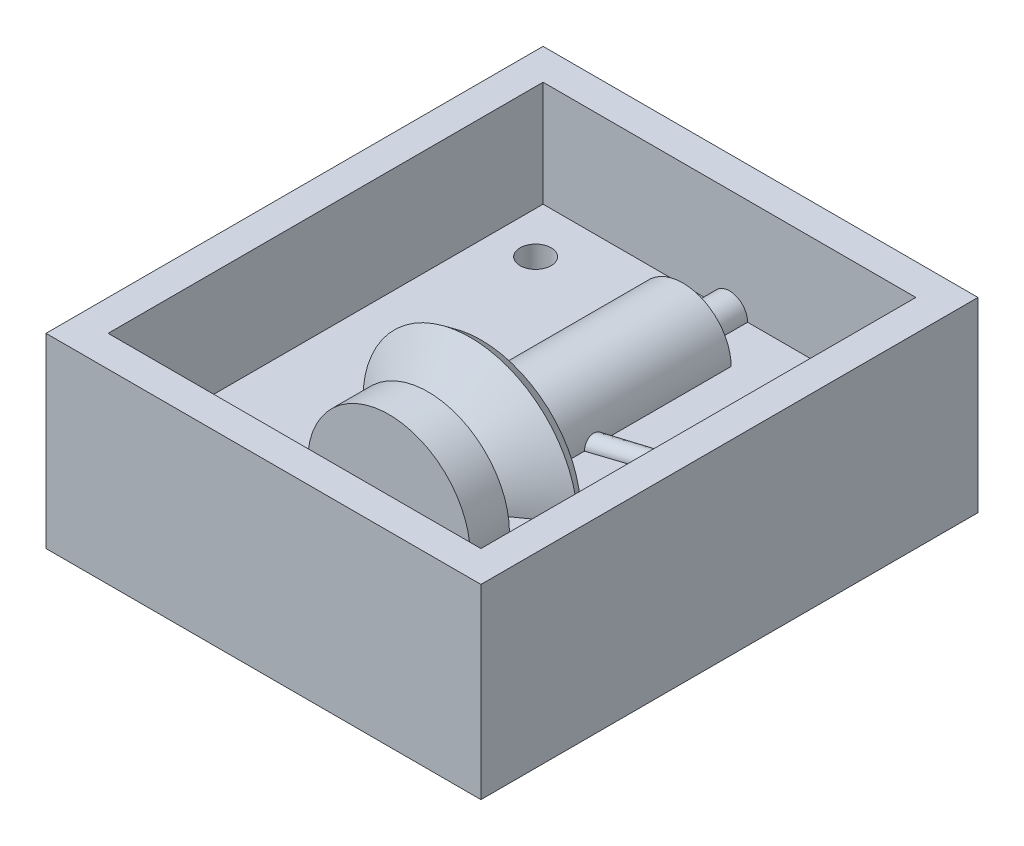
ISO-10303-21;
HEADER;
FILE_DESCRIPTION(('STEP AP214'),'2;1');
FILE_NAME('part.step','',(''),(''),'','','');
FILE_SCHEMA(('AUTOMOTIVE_DESIGN { 1 0 10303 214 1 1 1 1 }'));
ENDSEC;
DATA;
#1=APPLICATION_CONTEXT('core data for automotive mechanical design processes');
#2=APPLICATION_PROTOCOL_DEFINITION('international standard','automotive_design',2000,#1);
#3=PRODUCT_CONTEXT('',#1,'mechanical');
#4=PRODUCT('Part','Part','',(#3));
#5=PRODUCT_RELATED_PRODUCT_CATEGORY('part','',(#4));
#6=PRODUCT_DEFINITION_FORMATION('','',#4);
#7=PRODUCT_DEFINITION_CONTEXT('part definition',#1,'design');
#8=PRODUCT_DEFINITION('design','',#6,#7);
#9=PRODUCT_DEFINITION_SHAPE('','',#8);
#10=(LENGTH_UNIT() NAMED_UNIT(*) SI_UNIT(.MILLI.,.METRE.));
#11=(NAMED_UNIT(*) PLANE_ANGLE_UNIT() SI_UNIT($,.RADIAN.));
#12=(NAMED_UNIT(*) SI_UNIT($,.STERADIAN.) SOLID_ANGLE_UNIT());
#13=UNCERTAINTY_MEASURE_WITH_UNIT(LENGTH_MEASURE(1.E-05),#10,'distance_accuracy_value','');
#14=(GEOMETRIC_REPRESENTATION_CONTEXT(3) GLOBAL_UNCERTAINTY_ASSIGNED_CONTEXT((#13)) GLOBAL_UNIT_ASSIGNED_CONTEXT((#10,
#11,#12)) REPRESENTATION_CONTEXT('',''));
#15=CARTESIAN_POINT('',(0.,0.,0.));
#16=DIRECTION('',(0.,0.,1.));
#17=DIRECTION('',(1.,0.,0.));
#18=AXIS2_PLACEMENT_3D('',#15,#16,#17);
#19=CARTESIAN_POINT('',(0.,13.,0.));
#20=DIRECTION('',(0.,1.,0.));
#21=DIRECTION('',(0.,0.,1.));
#22=AXIS2_PLACEMENT_3D('',#19,#20,#21);
#23=PLANE('',#22);
#24=CARTESIAN_POINT('',(23.27604835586,13.,27.0745701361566));
#25=DIRECTION('',(0.,1.,0.));
#26=DIRECTION('',(0.,0.,1.));
#27=AXIS2_PLACEMENT_3D('',#24,#25,#26);
#28=CIRCLE('',#27,2.5);
#29=CARTESIAN_POINT('',(23.27604835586,13.,29.5745701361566));
#30=VERTEX_POINT('',#29);
#31=EDGE_CURVE('E704',#30,#30,#28,.T.);
#32=ORIENTED_EDGE('',*,*,#31,.F.);
#33=EDGE_LOOP('',(#32));
#34=FACE_BOUND('',#33,.T.);
#35=CARTESIAN_POINT('',(-23.27604835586,13.,27.0745701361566));
#36=DIRECTION('',(0.,1.,0.));
#37=DIRECTION('',(0.,0.,-1.));
#38=AXIS2_PLACEMENT_3D('',#35,#36,#37);
#39=CIRCLE('',#38,2.5);
#40=CARTESIAN_POINT('',(-23.27604835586,13.,24.5745701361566));
#41=VERTEX_POINT('',#40);
#42=EDGE_CURVE('E384',#41,#41,#39,.T.);
#43=ORIENTED_EDGE('',*,*,#42,.F.);
#44=EDGE_LOOP('',(#43));
#45=FACE_BOUND('',#44,.T.);
#46=CARTESIAN_POINT('',(-23.27604835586,13.,-27.0745701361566));
#47=DIRECTION('',(0.,1.,0.));
#48=DIRECTION('',(0.,0.,1.));
#49=AXIS2_PLACEMENT_3D('',#46,#47,#48);
#50=CIRCLE('',#49,2.5);
#51=CARTESIAN_POINT('',(-23.27604835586,13.,-24.5745701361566));
#52=VERTEX_POINT('',#51);
#53=EDGE_CURVE('E381',#52,#52,#50,.T.);
#54=ORIENTED_EDGE('',*,*,#53,.F.);
#55=EDGE_LOOP('',(#54));
#56=FACE_BOUND('',#55,.T.);
#57=DIRECTION('',(0.950522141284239,0.,-0.310656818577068));
#58=VECTOR('',#57,1.);
#59=CARTESIAN_POINT('',(245.010901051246,13.,-81.4429071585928));
#60=LINE('',#59,#58);
#61=CARTESIAN_POINT('',(7.75868278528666,13.,-3.90234694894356));
#62=VERTEX_POINT('',#61);
#63=CARTESIAN_POINT('',(30.,13.,-11.1714220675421));
#64=VERTEX_POINT('',#63);
#65=EDGE_CURVE('E394',#62,#64,#60,.T.);
#66=ORIENTED_EDGE('',*,*,#65,.F.);
#67=DIRECTION('',(0.,0.,-1.));
#68=VECTOR('',#67,1.);
#69=CARTESIAN_POINT('',(7.75868278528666,13.,-41.7837395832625));
#70=LINE('',#69,#68);
#71=CARTESIAN_POINT('',(7.75868278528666,13.,10.8758602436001));
#72=VERTEX_POINT('',#71);
#73=EDGE_CURVE('E317',#62,#72,#70,.F.);
#74=ORIENTED_EDGE('',*,*,#73,.T.);
#75=DIRECTION('',(0.814665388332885,0.,-0.57993129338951));
#76=VECTOR('',#75,1.);
#77=CARTESIAN_POINT('',(0.,13.,16.3989903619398));
#78=LINE('',#77,#76);
#79=CARTESIAN_POINT('',(16.0570986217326,13.,4.96851337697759));
#80=VERTEX_POINT('',#79);
#81=EDGE_CURVE('E314',#72,#80,#78,.T.);
#82=ORIENTED_EDGE('',*,*,#81,.T.);
#83=DIRECTION('',(-0.579931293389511,0.,-0.814665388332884));
#84=VECTOR('',#83,1.);
#85=CARTESIAN_POINT('',(0.,13.,-17.5878870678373));
#86=LINE('',#85,#84);
#87=CARTESIAN_POINT('',(17.2953970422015,13.,6.70802782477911));
#88=VERTEX_POINT('',#87);
#89=EDGE_CURVE('E311',#80,#88,#86,.F.);
#90=ORIENTED_EDGE('',*,*,#89,.T.);
#91=DIRECTION('',(0.814665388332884,0.,-0.579931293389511));
#92=VECTOR('',#91,1.);
#93=CARTESIAN_POINT('',(0.,13.,19.0200053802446));
#94=LINE('',#93,#92);
#95=CARTESIAN_POINT('',(7.75868278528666,13.,13.4968752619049));
#96=VERTEX_POINT('',#95);
#97=EDGE_CURVE('E308',#88,#96,#94,.F.);
#98=ORIENTED_EDGE('',*,*,#97,.T.);
#99=DIRECTION('',(1.,0.,0.));
#100=VECTOR('',#99,1.);
#101=CARTESIAN_POINT('',(0.,13.,13.4968752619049));
#102=LINE('',#101,#100);
#103=CARTESIAN_POINT('',(13.0927772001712,13.,13.4968752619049));
#104=VERTEX_POINT('',#103);
#105=EDGE_CURVE('E299',#96,#104,#102,.T.);
#106=ORIENTED_EDGE('',*,*,#105,.T.);
#107=DIRECTION('',(0.,0.,-1.));
#108=VECTOR('',#107,1.);
#109=CARTESIAN_POINT('',(13.0927772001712,13.,-41.7837395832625));
#110=LINE('',#109,#108);
#111=CARTESIAN_POINT('',(13.0927772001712,13.,19.8008050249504));
#112=VERTEX_POINT('',#111);
#113=EDGE_CURVE('E305',#104,#112,#110,.F.);
#114=ORIENTED_EDGE('',*,*,#113,.T.);
#115=DIRECTION('',(-1.,0.,0.));
#116=VECTOR('',#115,1.);
#117=CARTESIAN_POINT('',(0.,13.,19.8008050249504));
#118=LINE('',#117,#116);
#119=CARTESIAN_POINT('',(-13.0927772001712,13.,19.8008050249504));
#120=VERTEX_POINT('',#119);
#121=EDGE_CURVE('E302',#112,#120,#118,.T.);
#122=ORIENTED_EDGE('',*,*,#121,.T.);
#123=DIRECTION('',(0.,0.,-1.));
#124=VECTOR('',#123,1.);
#125=CARTESIAN_POINT('',(-13.0927772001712,13.,-41.7837395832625));
#126=LINE('',#125,#124);
#127=CARTESIAN_POINT('',(-13.0927772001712,13.,13.4968752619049));
#128=VERTEX_POINT('',#127);
#129=EDGE_CURVE('E298',#120,#128,#126,.T.);
#130=ORIENTED_EDGE('',*,*,#129,.T.);
#131=CARTESIAN_POINT('',(-7.75868278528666,13.,13.4968752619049));
#132=VERTEX_POINT('',#131);
#133=EDGE_CURVE('E295',#128,#132,#102,.T.);
#134=ORIENTED_EDGE('',*,*,#133,.T.);
#135=DIRECTION('',(0.814665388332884,0.,0.579931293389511));
#136=VECTOR('',#135,1.);
#137=CARTESIAN_POINT('',(0.,13.,19.0200053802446));
#138=LINE('',#137,#136);
#139=CARTESIAN_POINT('',(-17.2953970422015,13.,6.70802782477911));
#140=VERTEX_POINT('',#139);
#141=EDGE_CURVE('E292',#132,#140,#138,.F.);
#142=ORIENTED_EDGE('',*,*,#141,.T.);
#143=DIRECTION('',(-0.579931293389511,0.,0.814665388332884));
#144=VECTOR('',#143,1.);
#145=CARTESIAN_POINT('',(0.,13.,-17.5878870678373));
#146=LINE('',#145,#144);
#147=CARTESIAN_POINT('',(-16.0570986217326,13.,4.96851337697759));
#148=VERTEX_POINT('',#147);
#149=EDGE_CURVE('E289',#140,#148,#146,.F.);
#150=ORIENTED_EDGE('',*,*,#149,.T.);
#151=DIRECTION('',(0.814665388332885,0.,0.57993129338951));
#152=VECTOR('',#151,1.);
#153=CARTESIAN_POINT('',(0.,13.,16.3989903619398));
#154=LINE('',#153,#152);
#155=CARTESIAN_POINT('',(-7.75868278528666,13.,10.8758602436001));
#156=VERTEX_POINT('',#155);
#157=EDGE_CURVE('E286',#148,#156,#154,.T.);
#158=ORIENTED_EDGE('',*,*,#157,.T.);
#159=DIRECTION('',(0.,0.,-1.));
#160=VECTOR('',#159,1.);
#161=CARTESIAN_POINT('',(-7.75868278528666,13.,-41.7837395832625));
#162=LINE('',#161,#160);
#163=CARTESIAN_POINT('',(-7.75868278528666,13.,-27.5106058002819));
#164=VERTEX_POINT('',#163);
#165=EDGE_CURVE('E282',#156,#164,#162,.T.);
#166=ORIENTED_EDGE('',*,*,#165,.T.);
#167=DIRECTION('',(1.,0.,0.));
#168=VECTOR('',#167,1.);
#169=CARTESIAN_POINT('',(0.,13.,-27.5106058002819));
#170=LINE('',#169,#168);
#171=CARTESIAN_POINT('',(-2.9191090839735,13.,-27.5106058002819));
#172=VERTEX_POINT('',#171);
#173=EDGE_CURVE('E279',#164,#172,#170,.T.);
#174=ORIENTED_EDGE('',*,*,#173,.T.);
#175=DIRECTION('',(0.,0.,-1.));
#176=VECTOR('',#175,1.);
#177=CARTESIAN_POINT('',(-2.9191090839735,13.,-41.7837395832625));
#178=LINE('',#177,#176);
#179=CARTESIAN_POINT('',(-2.9191090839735,13.,-35.));
#180=VERTEX_POINT('',#179);
#181=EDGE_CURVE('E276',#172,#180,#178,.T.);
#182=ORIENTED_EDGE('',*,*,#181,.T.);
#183=DIRECTION('',(-1.,0.,0.));
#184=VECTOR('',#183,1.);
#185=CARTESIAN_POINT('',(30.,13.,-35.));
#186=LINE('',#185,#184);
#187=CARTESIAN_POINT('',(-30.,13.,-35.));
#188=VERTEX_POINT('',#187);
#189=EDGE_CURVE('E220',#180,#188,#186,.T.);
#190=ORIENTED_EDGE('',*,*,#189,.T.);
#191=DIRECTION('',(0.,0.,1.));
#192=VECTOR('',#191,1.);
#193=CARTESIAN_POINT('',(-30.,13.,35.));
#194=LINE('',#193,#192);
#195=CARTESIAN_POINT('',(-30.,13.,35.));
#196=VERTEX_POINT('',#195);
#197=EDGE_CURVE('E222',#188,#196,#194,.T.);
#198=ORIENTED_EDGE('',*,*,#197,.T.);
#199=DIRECTION('',(1.,0.,0.));
#200=VECTOR('',#199,1.);
#201=CARTESIAN_POINT('',(30.,13.,35.));
#202=LINE('',#201,#200);
#203=CARTESIAN_POINT('',(30.,13.,35.));
#204=VERTEX_POINT('',#203);
#205=EDGE_CURVE('E217',#196,#204,#202,.T.);
#206=ORIENTED_EDGE('',*,*,#205,.T.);
#207=DIRECTION('',(0.,0.,-1.));
#208=VECTOR('',#207,1.);
#209=CARTESIAN_POINT('',(30.,13.,35.));
#210=LINE('',#209,#208);
#211=EDGE_CURVE('E216',#204,#64,#210,.T.);
#212=ORIENTED_EDGE('',*,*,#211,.T.);
#213=EDGE_LOOP('',(#66,#74,#82,#90,#98,#106,#114,#122,#130,#134,#142,#150,#158,#166,#174,#182,
#190,#198,#206,#212));
#214=FACE_BOUND('',#213,.T.);
#215=ADVANCED_FACE('F35',(#34,#45,#56,#214),#23,.T.);
#216=CARTESIAN_POINT('',(0.,0.,0.));
#217=DIRECTION('',(0.,1.,0.));
#218=DIRECTION('',(0.,0.,1.));
#219=AXIS2_PLACEMENT_3D('',#216,#217,#218);
#220=PLANE('',#219);
#221=CARTESIAN_POINT('',(-25.2912885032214,0.,-1.22311134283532));
#222=CARTESIAN_POINT('',(-24.9886595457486,0.,-1.03151210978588));
#223=CARTESIAN_POINT('',(-24.6857079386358,0.,-0.840422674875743));
#224=CARTESIAN_POINT('',(-24.0790938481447,0.,-0.459372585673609));
#225=CARTESIAN_POINT('',(-23.7754313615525,0.,-0.269411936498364));
#226=CARTESIAN_POINT('',(-22.863236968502,0.,0.298639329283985));
#227=CARTESIAN_POINT('',(-22.253544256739,0.,0.674870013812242));
#228=CARTESIAN_POINT('',(-21.0285207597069,0.,1.42242268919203));
#229=CARTESIAN_POINT('',(-20.4131782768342,0.,1.79372553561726));
#230=CARTESIAN_POINT('',(-19.1779728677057,0.,2.52870718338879));
#231=CARTESIAN_POINT('',(-18.5581100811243,0.,2.89238621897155));
#232=CARTESIAN_POINT('',(-17.2607752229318,0.,3.64015219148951));
#233=CARTESIAN_POINT('',(-16.5828199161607,0.,4.02340287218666));
#234=CARTESIAN_POINT('',(-15.21867481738,0.,4.77522247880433));
#235=CARTESIAN_POINT('',(-14.5324842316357,0.,5.14378997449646));
#236=CARTESIAN_POINT('',(-13.4959059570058,0.,5.68163553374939));
#237=CARTESIAN_POINT('',(-13.1493599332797,0.,5.8583219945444));
#238=CARTESIAN_POINT('',(-12.4533980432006,0.,6.20594076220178));
#239=CARTESIAN_POINT('',(-12.1039822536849,0.,6.37687322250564));
#240=CARTESIAN_POINT('',(-11.4019998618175,0.,6.71199868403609));
#241=CARTESIAN_POINT('',(-11.049433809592,0.,6.87619283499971));
#242=CARTESIAN_POINT('',(-10.3407501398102,0.,7.19670633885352));
#243=CARTESIAN_POINT('',(-9.98463269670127,0.,7.35302607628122));
#244=CARTESIAN_POINT('',(-9.27407158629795,0.,7.65404366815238));
#245=CARTESIAN_POINT('',(-8.91968896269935,0.,7.79888513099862));
#246=CARTESIAN_POINT('',(-8.20678816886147,0.,8.07805050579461));
#247=CARTESIAN_POINT('',(-7.84827000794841,0.,8.21237444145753));
#248=CARTESIAN_POINT('',(-7.12678495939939,0.,8.46871127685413));
#249=CARTESIAN_POINT('',(-6.76381750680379,0.,8.59072259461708));
#250=CARTESIAN_POINT('',(-6.03333293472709,0.,8.82035844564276));
#251=CARTESIAN_POINT('',(-5.66581584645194,0.,8.92798307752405));
#252=CARTESIAN_POINT('',(-4.93631177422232,0.,9.12390668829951));
#253=CARTESIAN_POINT('',(-4.57444507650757,0.,9.21265058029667));
#254=CARTESIAN_POINT('',(-3.84679812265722,0.,9.3722565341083));
#255=CARTESIAN_POINT('',(-3.48101830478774,0.,9.44312057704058));
#256=CARTESIAN_POINT('',(-2.74631144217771,0.,9.56493684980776));
#257=CARTESIAN_POINT('',(-2.37738602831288,0.,9.61589882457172));
#258=CARTESIAN_POINT('',(-1.63718270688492,0.,9.69630332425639));
#259=CARTESIAN_POINT('',(-1.26590486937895,0.,9.72574648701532));
#260=CARTESIAN_POINT('',(-0.531902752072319,0.,9.7615970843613));
#261=CARTESIAN_POINT('',(-0.169206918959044,0.,9.76858325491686));
#262=CARTESIAN_POINT('',(0.555951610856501,0.,9.76090545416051));
#263=CARTESIAN_POINT('',(0.918414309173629,0.,9.74624163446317));
#264=CARTESIAN_POINT('',(1.64192147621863,0.,9.69577070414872));
#265=CARTESIAN_POINT('',(2.00296564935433,0.,9.65995939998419));
#266=CARTESIAN_POINT('',(2.72249764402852,0.,9.56836932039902));
#267=CARTESIAN_POINT('',(3.08098538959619,0.,9.51258995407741));
#268=CARTESIAN_POINT('',(3.80517197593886,0.,9.3807949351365));
#269=CARTESIAN_POINT('',(4.17076985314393,0.,9.30422877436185));
#270=CARTESIAN_POINT('',(4.89787690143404,0.,9.13376659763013));
#271=CARTESIAN_POINT('',(5.25938598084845,0.,9.039870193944));
#272=CARTESIAN_POINT('',(5.97817697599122,0.,8.83686779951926));
#273=CARTESIAN_POINT('',(6.3354578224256,0.,8.72775804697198));
#274=CARTESIAN_POINT('',(7.04569473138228,0.,8.49639234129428));
#275=CARTESIAN_POINT('',(7.39865093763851,0.,8.37413682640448));
#276=CARTESIAN_POINT('',(8.27756703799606,0.,8.05377724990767));
#277=CARTESIAN_POINT('',(8.80092396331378,0.,7.84853676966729));
#278=CARTESIAN_POINT('',(9.83930107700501,0.,7.41784248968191));
#279=CARTESIAN_POINT('',(10.3543193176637,0.,7.19238404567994));
#280=CARTESIAN_POINT('',(11.3774640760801,0.,6.72529055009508));
#281=CARTESIAN_POINT('',(11.8855843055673,0.,6.48364179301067));
#282=CARTESIAN_POINT('',(12.8955016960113,0.,5.98762816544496));
#283=CARTESIAN_POINT('',(13.3972993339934,0.,5.73326426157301));
#284=CARTESIAN_POINT('',(14.3975322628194,0.,5.21328946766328));
#285=CARTESIAN_POINT('',(14.8959464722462,0.,4.94763815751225));
#286=CARTESIAN_POINT('',(15.888231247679,0.,4.40798560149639));
#287=CARTESIAN_POINT('',(16.3821017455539,0.,4.13398423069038));
#288=CARTESIAN_POINT('',(17.3657555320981,0.,3.57928378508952));
#289=CARTESIAN_POINT('',(17.8555406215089,0.,3.29858789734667));
#290=CARTESIAN_POINT('',(18.8318248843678,0.,2.73155672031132));
#291=CARTESIAN_POINT('',(19.3183240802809,0.,2.44522146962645));
#292=CARTESIAN_POINT('',(20.6635320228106,0.,1.64470916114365));
#293=CARTESIAN_POINT('',(21.5192513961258,0.,1.12550964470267));
#294=CARTESIAN_POINT('',(23.2240805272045,0.,0.0761834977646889));
#295=CARTESIAN_POINT('',(24.0731894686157,0.,-0.453944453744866));
#296=CARTESIAN_POINT('',(25.7587021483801,0.,-1.51774772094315));
#297=CARTESIAN_POINT('',(26.5951518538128,0.,-2.05135029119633));
#298=CARTESIAN_POINT('',(27.8466963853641,0.,-2.85644322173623));
#299=CARTESIAN_POINT('',(28.2633188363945,0.,-3.1255645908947));
#300=CARTESIAN_POINT('',(29.0956465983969,0.,-3.66521768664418));
#301=CARTESIAN_POINT('',(29.5113519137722,0.,-3.93574940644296));
#302=CARTESIAN_POINT('',(29.9266510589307,0.,-4.20690349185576));
#303=B_SPLINE_CURVE_WITH_KNOTS('',3,(#221,#222,#223,#224,#225,#226,#227,#228,#229,#230,#231,
#232,#233,#234,#235,#236,#237,#238,#239,#240,#241,#242,#243,#244,#245,#246,#247,#248,#249,#250,
#251,#252,#253,#254,#255,#256,#257,#258,#259,#260,#261,#262,#263,#264,#265,#266,#267,#268,#269,
#270,#271,#272,#273,#274,#275,#276,#277,#278,#279,#280,#281,#282,#283,#284,#285,#286,#287,#288,
#289,#290,#291,#292,#293,#294,#295,#296,#297,#298,#299,#300,#301,#302),.UNSPECIFIED.,.F.,.F.,(4,
2,2,2,2,2,2,2,2,2,2,2,2,2,2,2,2,2,2,2,2,2,2,2,2,2,2,2,2,2,2,2,2,2,2,2,2,2,2,2,4),(0.,
1.07454590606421,2.14909667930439,4.2983620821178,6.45438257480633,8.61033672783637,
10.9465616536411,13.2830135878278,14.4499375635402,15.6168303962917,16.7835232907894,
17.950159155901,19.0985350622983,20.246908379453,21.3954290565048,22.5439418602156,
23.6613105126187,24.7785553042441,25.8952523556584,27.0119163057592,28.0995620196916,
29.1872001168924,30.2750539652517,31.3629400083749,32.4830522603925,33.6031895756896,
34.7236043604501,35.8439818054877,37.5298882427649,39.2161829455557,40.9039236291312,
42.5915362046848,44.2858081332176,45.9801054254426,47.6736116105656,49.3671062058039,
52.3697165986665,55.3726920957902,58.349130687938,59.8370819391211,61.3250260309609),.UNSPECIFIED.);
#304=CARTESIAN_POINT('',(11.4074869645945,0.,6.70802782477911));
#305=VERTEX_POINT('',#304);
#306=CARTESIAN_POINT('',(-11.4074869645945,0.,6.70802782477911));
#307=VERTEX_POINT('',#306);
#308=EDGE_CURVE('E461',#305,#307,#303,.F.);
#309=ORIENTED_EDGE('',*,*,#308,.F.);
#310=CARTESIAN_POINT('',(-29.3372990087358,0.,27.4889309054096));
#311=CARTESIAN_POINT('',(-28.9705383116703,0.,27.0179002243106));
#312=CARTESIAN_POINT('',(-28.6030814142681,0.,26.5474114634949));
#313=CARTESIAN_POINT('',(-27.8666027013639,0.,25.6076570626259));
#314=CARTESIAN_POINT('',(-27.4975808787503,0.,25.1383914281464));
#315=CARTESIAN_POINT('',(-26.3878020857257,0.,23.7325024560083));
#316=CARTESIAN_POINT('',(-25.6444429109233,0.,22.7979299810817));
#317=CARTESIAN_POINT('',(-24.1436940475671,0.,20.9291419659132));
#318=CARTESIAN_POINT('',(-23.3862421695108,0.,19.9949762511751));
#319=CARTESIAN_POINT('',(-22.241558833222,0.,18.6007813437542));
#320=CARTESIAN_POINT('',(-21.8585972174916,0.,18.1372456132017));
#321=CARTESIAN_POINT('',(-21.0894049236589,0.,17.2128958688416));
#322=CARTESIAN_POINT('',(-20.703174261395,0.,16.7520818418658));
#323=CARTESIAN_POINT('',(-19.9268383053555,0.,15.8334948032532));
#324=CARTESIAN_POINT('',(-19.5367319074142,0.,15.3757227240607));
#325=CARTESIAN_POINT('',(-18.7521604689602,0.,14.4639327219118));
#326=CARTESIAN_POINT('',(-18.3576954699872,0.,14.0099147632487));
#327=CARTESIAN_POINT('',(-17.5635499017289,0.,13.1062102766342));
#328=CARTESIAN_POINT('',(-17.1638677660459,0.,12.6565251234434));
#329=CARTESIAN_POINT('',(-16.3585078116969,0.,11.762556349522));
#330=CARTESIAN_POINT('',(-15.9528300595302,0.,11.3182726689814));
#331=CARTESIAN_POINT('',(-15.1357652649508,0.,10.4378312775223));
#332=CARTESIAN_POINT('',(-14.7244028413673,0.,10.0016507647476));
#333=CARTESIAN_POINT('',(-13.8931776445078,0.,9.13739782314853));
#334=CARTESIAN_POINT('',(-13.4733144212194,0.,8.70932582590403));
#335=CARTESIAN_POINT('',(-12.6235545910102,0.,7.86367787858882));
#336=CARTESIAN_POINT('',(-12.1936633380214,0.,7.44609656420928));
#337=CARTESIAN_POINT('',(-11.3214288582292,0.,6.62419243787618));
#338=CARTESIAN_POINT('',(-10.8790874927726,0.,6.21986766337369));
#339=CARTESIAN_POINT('',(-10.1123487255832,0.,5.54589010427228));
#340=CARTESIAN_POINT('',(-9.79183396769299,0.,5.27182728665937));
#341=CARTESIAN_POINT('',(-9.14192081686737,0.,4.73437813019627));
#342=CARTESIAN_POINT('',(-8.81252219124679,0.,4.47099207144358));
#343=CARTESIAN_POINT('',(-8.1423577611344,0.,3.95673451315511));
#344=CARTESIAN_POINT('',(-7.80155884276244,0.,3.70590592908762));
#345=CARTESIAN_POINT('',(-7.10799710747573,0.,3.22123618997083));
#346=CARTESIAN_POINT('',(-6.75523402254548,0.,2.98739541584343));
#347=CARTESIAN_POINT('',(-6.02990485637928,0.,2.53760358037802));
#348=CARTESIAN_POINT('',(-5.65710250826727,0.,2.32202945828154));
#349=CARTESIAN_POINT('',(-4.89591043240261,0.,1.91987758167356));
#350=CARTESIAN_POINT('',(-4.50751751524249,0.,1.73330579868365));
#351=CARTESIAN_POINT('',(-3.71671682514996,0.,1.39839400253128));
#352=CARTESIAN_POINT('',(-3.31439842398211,0.,1.24984828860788));
#353=CARTESIAN_POINT('',(-2.70050968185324,0.,1.06176706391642));
#354=CARTESIAN_POINT('',(-2.4941955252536,0.,1.0048723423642));
#355=CARTESIAN_POINT('',(-2.07850781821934,0.,0.903727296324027));
#356=CARTESIAN_POINT('',(-1.86913484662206,0.,0.859474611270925));
#357=CARTESIAN_POINT('',(-1.38772278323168,0.,0.773898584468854));
#358=CARTESIAN_POINT('',(-1.11487434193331,0.,0.737026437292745));
#359=CARTESIAN_POINT('',(-0.567030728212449,0.,0.687348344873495));
#360=CARTESIAN_POINT('',(-0.292035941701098,0.,0.674538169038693));
#361=CARTESIAN_POINT('',(0.257838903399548,0.,0.673528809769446));
#362=CARTESIAN_POINT('',(0.532718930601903,0.,0.685314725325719));
#363=CARTESIAN_POINT('',(1.0803883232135,0.,0.732948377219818));
#364=CARTESIAN_POINT('',(1.35317737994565,0.,0.768799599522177));
#365=CARTESIAN_POINT('',(1.95319222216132,0.,0.873288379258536));
#366=CARTESIAN_POINT('',(2.27947828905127,0.,0.947327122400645));
#367=CARTESIAN_POINT('',(2.92387368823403,0.,1.12494597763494));
#368=CARTESIAN_POINT('',(3.2419803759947,0.,1.22853551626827));
#369=CARTESIAN_POINT('',(3.86992599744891,0.,1.46123473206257));
#370=CARTESIAN_POINT('',(4.17973081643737,0.,1.59043547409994));
#371=CARTESIAN_POINT('',(4.78959451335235,0.,1.86981993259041));
#372=CARTESIAN_POINT('',(5.08965416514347,0.,2.02000197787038));
#373=CARTESIAN_POINT('',(5.75932076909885,0.,2.3800069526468));
#374=CARTESIAN_POINT('',(6.12610917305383,0.,2.59504841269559));
#375=CARTESIAN_POINT('',(6.84625746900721,0.,3.04669259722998));
#376=CARTESIAN_POINT('',(7.19961048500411,0.,3.28330615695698));
#377=CARTESIAN_POINT('',(7.89504526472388,0.,3.77378758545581));
#378=CARTESIAN_POINT('',(8.23710471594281,0.,4.02768689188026));
#379=CARTESIAN_POINT('',(8.91081443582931,0.,4.54875296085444));
#380=CARTESIAN_POINT('',(9.24246641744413,0.,4.81591752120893));
#381=CARTESIAN_POINT('',(9.90057685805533,0.,5.36398057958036));
#382=CARTESIAN_POINT('',(10.2269338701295,0.,5.64500040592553));
#383=CARTESIAN_POINT('',(10.8718388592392,0.,6.21585259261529));
#384=CARTESIAN_POINT('',(11.1903865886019,0.,6.50568523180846));
#385=CARTESIAN_POINT('',(11.8203923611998,0.,7.0922289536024));
#386=CARTESIAN_POINT('',(12.131858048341,0.,7.38893184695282));
#387=CARTESIAN_POINT('',(12.7489769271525,0.,7.98830025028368));
#388=CARTESIAN_POINT('',(13.0546301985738,0.,8.29096567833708));
#389=CARTESIAN_POINT('',(13.7322209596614,0.,8.97309738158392));
#390=CARTESIAN_POINT('',(14.102833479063,0.,9.35387849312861));
#391=CARTESIAN_POINT('',(14.8375654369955,0.,10.1216644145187));
#392=CARTESIAN_POINT('',(15.2016846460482,0.,10.5086694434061));
#393=CARTESIAN_POINT('',(15.9244261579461,0.,11.2878706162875));
#394=CARTESIAN_POINT('',(16.2830476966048,0.,11.6800674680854));
#395=CARTESIAN_POINT('',(16.9955225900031,0.,12.4687561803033));
#396=CARTESIAN_POINT('',(17.3493759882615,0.,12.8652480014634));
#397=CARTESIAN_POINT('',(18.0533520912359,0.,13.662305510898));
#398=CARTESIAN_POINT('',(18.4034702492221,0.,14.0628752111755));
#399=CARTESIAN_POINT('',(19.1001127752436,0.,14.8671294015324));
#400=CARTESIAN_POINT('',(19.4466371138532,0.,15.2708139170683));
#401=CARTESIAN_POINT('',(20.4815249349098,0.,16.4858839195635));
#402=CARTESIAN_POINT('',(21.1651919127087,0.,17.3012729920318));
#403=CARTESIAN_POINT('',(22.1632266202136,0.,18.5060807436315));
#404=CARTESIAN_POINT('',(22.4813975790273,0.,18.8923648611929));
#405=CARTESIAN_POINT('',(23.1157898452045,0.,19.6665207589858));
#406=CARTESIAN_POINT('',(23.4320111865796,0.,20.0543925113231));
#407=CARTESIAN_POINT('',(24.3780843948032,0.,21.2201482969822));
#408=CARTESIAN_POINT('',(25.0053267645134,0.,22.0001502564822));
#409=CARTESIAN_POINT('',(26.2526968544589,0.,23.5628804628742));
#410=CARTESIAN_POINT('',(26.8728376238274,0.,24.3455983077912));
#411=CARTESIAN_POINT('',(27.7995194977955,0.,25.5224201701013));
#412=CARTESIAN_POINT('',(28.1078178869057,0.,25.9151421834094));
#413=CARTESIAN_POINT('',(28.7233399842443,0.,26.7014263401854));
#414=CARTESIAN_POINT('',(29.0305636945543,0.,27.0949884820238));
#415=CARTESIAN_POINT('',(29.3372990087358,0.,27.4889309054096));
#416=B_SPLINE_CURVE_WITH_KNOTS('',3,(#310,#311,#312,#313,#314,#315,#316,#317,#318,#319,#320,
#321,#322,#323,#324,#325,#326,#327,#328,#329,#330,#331,#332,#333,#334,#335,#336,#337,#338,#339,
#340,#341,#342,#343,#344,#345,#346,#347,#348,#349,#350,#351,#352,#353,#354,#355,#356,#357,#358,
#359,#360,#361,#362,#363,#364,#365,#366,#367,#368,#369,#370,#371,#372,#373,#374,#375,#376,#377,
#378,#379,#380,#381,#382,#383,#384,#385,#386,#387,#388,#389,#390,#391,#392,#393,#394,#395,#396,
#397,#398,#399,#400,#401,#402,#403,#404,#405,#406,#407,#408,#409,#410,#411,#412,#413,#414,#415),
.UNSPECIFIED.,.F.,.F.,(4,2,2,2,2,2,2,2,2,2,2,2,2,2,2,2,2,2,2,2,2,2,2,2,2,2,2,2,2,2,2,2,2,2,2,2,
2,2,2,2,2,2,2,2,2,2,2,2,2,2,2,2,4),(0.,1.7909346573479,3.58187746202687,7.16430619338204,
10.7722173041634,12.5760137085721,14.3798013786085,16.1841185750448,17.9884185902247,
19.7932733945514,21.5981081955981,23.3966965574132,25.1953803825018,26.9931249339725,
28.7906021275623,30.0555534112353,31.3205378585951,32.5895855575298,33.858661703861,
35.1495687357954,36.4407412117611,37.7247740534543,38.366483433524,39.0080729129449,
39.8330140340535,40.657810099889,41.482106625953,42.3065225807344,43.3086320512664,
44.3110615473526,45.3171214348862,46.3231012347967,47.5976413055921,48.8728251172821,
50.1503934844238,51.4277504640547,52.7195829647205,54.011456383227,55.3018620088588,
56.592249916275,58.1862464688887,59.7802992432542,61.3745716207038,62.9688294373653,
64.5648461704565,66.16087596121,69.3529869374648,70.854327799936,72.3556423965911,
75.3583595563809,78.3541679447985,79.8520002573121,81.3498296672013),.UNSPECIFIED.);
#417=CARTESIAN_POINT('',(9.42498892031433,0.,4.96851337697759));
#418=VERTEX_POINT('',#417);
#419=EDGE_CURVE('E434',#418,#305,#416,.T.);
#420=ORIENTED_EDGE('',*,*,#419,.F.);
#421=CARTESIAN_POINT('',(-24.1809221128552,0.,-3.14446865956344));
#422=CARTESIAN_POINT('',(-23.8850641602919,0.,-2.95896869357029));
#423=CARTESIAN_POINT('',(-23.5888649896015,0.,-2.77401314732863));
#424=CARTESIAN_POINT('',(-22.995714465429,0.,-2.40530868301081));
#425=CARTESIAN_POINT('',(-22.6987631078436,0.,-2.22155977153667));
#426=CARTESIAN_POINT('',(-21.8066268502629,0.,-1.67226937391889));
#427=CARTESIAN_POINT('',(-21.2102136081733,0.,-1.30871804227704));
#428=CARTESIAN_POINT('',(-20.0112264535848,0.,-0.586793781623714));
#429=CARTESIAN_POINT('',(-19.4086378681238,0.,-0.228445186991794));
#430=CARTESIAN_POINT('',(-18.198675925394,0.,0.480050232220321));
#431=CARTESIAN_POINT('',(-17.5913027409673,0.,0.830197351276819));
#432=CARTESIAN_POINT('',(-16.321958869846,0.,1.54768900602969));
#433=CARTESIAN_POINT('',(-15.6595011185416,0.,1.91417428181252));
#434=CARTESIAN_POINT('',(-14.3259630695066,0.,2.63141510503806));
#435=CARTESIAN_POINT('',(-13.654881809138,0.,2.98216887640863));
#436=CARTESIAN_POINT('',(-12.6407276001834,0.,3.49221558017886));
#437=CARTESIAN_POINT('',(-12.3016442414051,0.,3.65944673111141));
#438=CARTESIAN_POINT('',(-11.6205147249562,0.,3.98775208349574));
#439=CARTESIAN_POINT('',(-11.2784686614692,0.,4.14882647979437));
#440=CARTESIAN_POINT('',(-10.591151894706,0.,4.46377392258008));
#441=CARTESIAN_POINT('',(-10.2458818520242,0.,4.61764840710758));
#442=CARTESIAN_POINT('',(-9.5517338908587,0.,4.91700443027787));
#443=CARTESIAN_POINT('',(-9.20285618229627,0.,5.06248645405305));
#444=CARTESIAN_POINT('',(-8.50614200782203,0.,5.34163167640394));
#445=CARTESIAN_POINT('',(-8.15836130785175,0.,5.47543354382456));
#446=CARTESIAN_POINT('',(-7.45869708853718,0.,5.73189203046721));
#447=CARTESIAN_POINT('',(-7.10681358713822,0.,5.85454869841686));
#448=CARTESIAN_POINT('',(-6.39876081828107,0.,6.08689168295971));
#449=CARTESIAN_POINT('',(-6.04259148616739,0.,6.19657780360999));
#450=CARTESIAN_POINT('',(-5.32595069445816,0.,6.40095681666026));
#451=CARTESIAN_POINT('',(-4.96547927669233,0.,6.49564985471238));
#452=CARTESIAN_POINT('',(-4.24974677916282,0.,6.66570491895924));
#453=CARTESIAN_POINT('',(-3.89458949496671,0.,6.7415007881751));
#454=CARTESIAN_POINT('',(-3.18085284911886,0.,6.87491227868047));
#455=CARTESIAN_POINT('',(-2.82227354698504,0.,6.93252821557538));
#456=CARTESIAN_POINT('',(-2.10261935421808,0.,7.02786622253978));
#457=CARTESIAN_POINT('',(-1.74154565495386,0.,7.06559720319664));
#458=CARTESIAN_POINT('',(-1.01780666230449,0.,7.11996708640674));
#459=CARTESIAN_POINT('',(-0.655141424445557,0.,7.13660671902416));
#460=CARTESIAN_POINT('',(0.0467093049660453,0.,7.14784002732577));
#461=CARTESIAN_POINT('',(0.385873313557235,0.,7.14380919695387));
#462=CARTESIAN_POINT('',(1.06344828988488,0.,7.11696358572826));
#463=CARTESIAN_POINT('',(1.40185926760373,0.,7.09414905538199));
#464=CARTESIAN_POINT('',(2.07702472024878,0.,7.03041066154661));
#465=CARTESIAN_POINT('',(2.41377884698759,0.,6.98948314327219));
#466=CARTESIAN_POINT('',(3.084774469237,0.,6.89065458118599));
#467=CARTESIAN_POINT('',(3.41901590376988,0.,6.83275312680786));
#468=CARTESIAN_POINT('',(4.09362659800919,0.,6.69959730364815));
#469=CARTESIAN_POINT('',(4.43390919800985,0.,6.62390675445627));
#470=CARTESIAN_POINT('',(5.11085176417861,0.,6.45783982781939));
#471=CARTESIAN_POINT('',(5.44751167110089,0.,6.36746321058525));
#472=CARTESIAN_POINT('',(6.1170826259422,0.,6.17375517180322));
#473=CARTESIAN_POINT('',(6.44999347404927,0.,6.07042306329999));
#474=CARTESIAN_POINT('',(7.11205716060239,0.,5.8524544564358));
#475=CARTESIAN_POINT('',(7.44121013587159,0.,5.73781837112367));
#476=CARTESIAN_POINT('',(8.30350853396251,0.,5.42294789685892));
#477=CARTESIAN_POINT('',(8.83366620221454,0.,5.21452675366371));
#478=CARTESIAN_POINT('',(9.88544930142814,0.,4.77705494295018));
#479=CARTESIAN_POINT('',(10.407072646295,0.,4.54799931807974));
#480=CARTESIAN_POINT('',(11.4432990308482,0.,4.07341921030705));
#481=CARTESIAN_POINT('',(11.9578953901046,0.,3.8278802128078));
#482=CARTESIAN_POINT('',(12.9806475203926,0.,3.32389793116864));
#483=CARTESIAN_POINT('',(13.4888037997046,0.,3.0654556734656));
#484=CARTESIAN_POINT('',(14.5018167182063,0.,2.53711669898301));
#485=CARTESIAN_POINT('',(15.0066506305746,0.,2.26717654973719));
#486=CARTESIAN_POINT('',(16.0117115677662,0.,1.71885590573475));
#487=CARTESIAN_POINT('',(16.5119385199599,0.,1.44047527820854));
#488=CARTESIAN_POINT('',(17.5082482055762,0.,0.876961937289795));
#489=CARTESIAN_POINT('',(18.0043328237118,0.,0.591832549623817));
#490=CARTESIAN_POINT('',(18.9931828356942,0.,0.0158934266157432));
#491=CARTESIAN_POINT('',(19.4859482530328,0.,-0.274916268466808));
#492=CARTESIAN_POINT('',(20.8477671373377,0.,-1.08743669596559));
#493=CARTESIAN_POINT('',(21.7138134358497,0.,-1.61418649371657));
#494=CARTESIAN_POINT('',(23.4392717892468,0.,-2.67864019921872));
#495=CARTESIAN_POINT('',(24.2986829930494,0.,-3.21634548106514));
#496=CARTESIAN_POINT('',(26.0044785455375,0.,-4.29510534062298));
#497=CARTESIAN_POINT('',(26.8509102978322,0.,-4.83608504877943));
#498=CARTESIAN_POINT('',(28.1174230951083,0.,-5.65223748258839));
#499=CARTESIAN_POINT('',(28.5390329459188,0.,-5.9250434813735));
#500=CARTESIAN_POINT('',(29.3813353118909,0.,-6.47206384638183));
#501=CARTESIAN_POINT('',(29.8020278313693,0.,-6.7462782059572));
#502=CARTESIAN_POINT('',(30.2223143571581,0.,-7.02111369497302));
#503=B_SPLINE_CURVE_WITH_KNOTS('',3,(#421,#422,#423,#424,#425,#426,#427,#428,#429,#430,#431,
#432,#433,#434,#435,#436,#437,#438,#439,#440,#441,#442,#443,#444,#445,#446,#447,#448,#449,#450,
#451,#452,#453,#454,#455,#456,#457,#458,#459,#460,#461,#462,#463,#464,#465,#466,#467,#468,#469,
#470,#471,#472,#473,#474,#475,#476,#477,#478,#479,#480,#481,#482,#483,#484,#485,#486,#487,#488,
#489,#490,#491,#492,#493,#494,#495,#496,#497,#498,#499,#500,#501,#502),.UNSPECIFIED.,.F.,.F.,(4,
2,2,2,2,2,2,2,2,2,2,2,2,2,2,2,2,2,2,2,2,2,2,2,2,2,2,2,2,2,2,2,2,2,2,2,2,2,2,2,4),(0.,
1.04760543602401,2.09521659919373,4.19062966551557,6.29384823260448,8.39699116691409,
10.6680661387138,12.9393968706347,14.0735848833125,15.2077369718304,16.3416615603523,
17.4755205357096,18.5932526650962,19.7109799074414,20.828724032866,21.9464572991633,
23.0354972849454,24.1245183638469,25.2130510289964,26.3015460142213,27.3185872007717,
28.3356148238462,29.3528477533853,30.3701052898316,31.4155359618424,32.4609837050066,
33.5064869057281,34.5519519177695,36.260310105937,37.9690798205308,39.6793744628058,
41.3895332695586,43.1068531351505,44.8242000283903,46.540717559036,48.2572229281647,
51.2980720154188,54.339304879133,57.3528941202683,58.8594118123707,60.3659223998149),.UNSPECIFIED.);
#504=CARTESIAN_POINT('',(-9.42498892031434,0.,4.96851337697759));
#505=VERTEX_POINT('',#504);
#506=EDGE_CURVE('E428',#505,#418,#503,.T.);
#507=ORIENTED_EDGE('',*,*,#506,.F.);
#508=EDGE_CURVE('E468',#307,#505,#416,.T.);
#509=ORIENTED_EDGE('',*,*,#508,.F.);
#510=EDGE_LOOP('',(#309,#420,#507,#509));
#511=FACE_BOUND('',#510,.T.);
#512=DIRECTION('',(0.,0.,1.));
#513=VECTOR('',#512,1.);
#514=CARTESIAN_POINT('',(-35.,0.,40.));
#515=LINE('',#514,#513);
#516=CARTESIAN_POINT('',(-35.,0.,-40.));
#517=VERTEX_POINT('',#516);
#518=CARTESIAN_POINT('',(-35.,0.,40.));
#519=VERTEX_POINT('',#518);
#520=EDGE_CURVE('E241',#517,#519,#515,.T.);
#521=ORIENTED_EDGE('',*,*,#520,.F.);
#522=DIRECTION('',(-1.,0.,0.));
#523=VECTOR('',#522,1.);
#524=CARTESIAN_POINT('',(35.,0.,-40.));
#525=LINE('',#524,#523);
#526=CARTESIAN_POINT('',(35.,0.,-40.));
#527=VERTEX_POINT('',#526);
#528=EDGE_CURVE('E251',#527,#517,#525,.T.);
#529=ORIENTED_EDGE('',*,*,#528,.F.);
#530=DIRECTION('',(0.,0.,-1.));
#531=VECTOR('',#530,1.);
#532=CARTESIAN_POINT('',(35.,0.,40.));
#533=LINE('',#532,#531);
#534=CARTESIAN_POINT('',(35.,0.,40.));
#535=VERTEX_POINT('',#534);
#536=EDGE_CURVE('E262',#535,#527,#533,.T.);
#537=ORIENTED_EDGE('',*,*,#536,.F.);
#538=DIRECTION('',(1.,0.,0.));
#539=VECTOR('',#538,1.);
#540=CARTESIAN_POINT('',(35.,0.,40.));
#541=LINE('',#540,#539);
#542=EDGE_CURVE('E260',#519,#535,#541,.T.);
#543=ORIENTED_EDGE('',*,*,#542,.F.);
#544=EDGE_LOOP('',(#521,#529,#537,#543));
#545=FACE_BOUND('',#544,.T.);
#546=DIRECTION('',(-1.,0.,0.));
#547=VECTOR('',#546,1.);
#548=CARTESIAN_POINT('',(0.,0.,19.8008050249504));
#549=LINE('',#548,#547);
#550=CARTESIAN_POINT('',(1.55589678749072,0.,19.8008050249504));
#551=VERTEX_POINT('',#550);
#552=CARTESIAN_POINT('',(-1.55589678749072,0.,19.8008050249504));
#553=VERTEX_POINT('',#552);
#554=EDGE_CURVE('E58',#551,#553,#549,.T.);
#555=ORIENTED_EDGE('',*,*,#554,.F.);
#556=DIRECTION('',(0.,0.,-1.));
#557=VECTOR('',#556,1.);
#558=CARTESIAN_POINT('',(1.55589678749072,0.,-41.7837395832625));
#559=LINE('',#558,#557);
#560=CARTESIAN_POINT('',(1.55589678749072,0.,13.4968752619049));
#561=VERTEX_POINT('',#560);
#562=EDGE_CURVE('E474',#561,#551,#559,.F.);
#563=ORIENTED_EDGE('',*,*,#562,.F.);
#564=DIRECTION('',(1.,0.,0.));
#565=VECTOR('',#564,1.);
#566=CARTESIAN_POINT('',(0.,0.,13.4968752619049));
#567=LINE('',#566,#565);
#568=CARTESIAN_POINT('',(-1.55589678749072,0.,13.4968752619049));
#569=VERTEX_POINT('',#568);
#570=EDGE_CURVE('E467',#569,#561,#567,.T.);
#571=ORIENTED_EDGE('',*,*,#570,.F.);
#572=DIRECTION('',(0.,0.,-1.));
#573=VECTOR('',#572,1.);
#574=CARTESIAN_POINT('',(-1.55589678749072,0.,-41.7837395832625));
#575=LINE('',#574,#573);
#576=EDGE_CURVE('E471',#553,#569,#575,.T.);
#577=ORIENTED_EDGE('',*,*,#576,.F.);
#578=EDGE_LOOP('',(#555,#563,#571,#577));
#579=FACE_BOUND('',#578,.T.);
#580=ADVANCED_FACE('F351',(#511,#545,#579),#220,.F.);
#581=CARTESIAN_POINT('',(30.,13.,-35.));
#582=DIRECTION('',(0.,0.,-1.));
#583=DIRECTION('',(-1.,0.,0.));
#584=AXIS2_PLACEMENT_3D('',#581,#582,#583);
#585=PLANE('',#584);
#586=CARTESIAN_POINT('',(0.,13.,-35.));
#587=DIRECTION('',(0.,0.,-1.));
#588=DIRECTION('',(-1.,0.,0.));
#589=AXIS2_PLACEMENT_3D('',#586,#587,#588);
#590=CIRCLE('',#589,2.9191090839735);
#591=CARTESIAN_POINT('',(2.9191090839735,13.,-35.));
#592=VERTEX_POINT('',#591);
#593=EDGE_CURVE('E209',#180,#592,#590,.T.);
#594=ORIENTED_EDGE('',*,*,#593,.T.);
#595=CARTESIAN_POINT('',(30.,13.,-35.));
#596=VERTEX_POINT('',#595);
#597=EDGE_CURVE('E226',#596,#592,#186,.T.);
#598=ORIENTED_EDGE('',*,*,#597,.F.);
#599=DIRECTION('',(0.,1.,0.));
#600=VECTOR('',#599,1.);
#601=CARTESIAN_POINT('',(30.,13.,-35.));
#602=LINE('',#601,#600);
#603=CARTESIAN_POINT('',(30.,30.,-35.));
#604=VERTEX_POINT('',#603);
#605=EDGE_CURVE('E214',#596,#604,#602,.T.);
#606=ORIENTED_EDGE('',*,*,#605,.T.);
#607=DIRECTION('',(-1.,0.,0.));
#608=VECTOR('',#607,1.);
#609=CARTESIAN_POINT('',(30.,30.,-35.));
#610=LINE('',#609,#608);
#611=CARTESIAN_POINT('',(-30.,30.,-35.));
#612=VERTEX_POINT('',#611);
#613=EDGE_CURVE('E236',#604,#612,#610,.T.);
#614=ORIENTED_EDGE('',*,*,#613,.T.);
#615=DIRECTION('',(0.,1.,0.));
#616=VECTOR('',#615,1.);
#617=CARTESIAN_POINT('',(-30.,13.,-35.));
#618=LINE('',#617,#616);
#619=EDGE_CURVE('E239',#188,#612,#618,.T.);
#620=ORIENTED_EDGE('',*,*,#619,.F.);
#621=ORIENTED_EDGE('',*,*,#189,.F.);
#622=EDGE_LOOP('',(#594,#598,#606,#614,#620,#621));
#623=FACE_BOUND('',#622,.T.);
#624=ADVANCED_FACE('F357',(#623),#585,.F.);
#625=CARTESIAN_POINT('',(23.27604835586,13.,-27.0745701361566));
#626=DIRECTION('',(0.,1.,0.));
#627=DIRECTION('',(0.,0.,-1.));
#628=AXIS2_PLACEMENT_3D('',#625,#626,#627);
#629=CIRCLE('',#628,2.5);
#630=CARTESIAN_POINT('',(23.27604835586,13.,-29.5745701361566));
#631=VERTEX_POINT('',#630);
#632=EDGE_CURVE('E375',#631,#631,#629,.T.);
#633=ORIENTED_EDGE('',*,*,#632,.F.);
#634=EDGE_LOOP('',(#633));
#635=FACE_BOUND('',#634,.T.);
#636=DIRECTION('',(-0.954413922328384,0.,0.298486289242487));
#637=VECTOR('',#636,1.);
#638=CARTESIAN_POINT('',(245.010901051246,13.,-81.4429071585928));
#639=LINE('',#638,#637);
#640=CARTESIAN_POINT('',(29.9631557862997,13.,-14.1882265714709));
#641=VERTEX_POINT('',#640);
#642=CARTESIAN_POINT('',(7.75868278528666,13.,-7.24393270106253));
#643=VERTEX_POINT('',#642);
#644=EDGE_CURVE('E50',#641,#643,#639,.T.);
#645=ORIENTED_EDGE('',*,*,#644,.F.);
#646=DIRECTION('',(0.0245628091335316,0.,0.999698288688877));
#647=VECTOR('',#646,1.);
#648=CARTESIAN_POINT('',(30.,13.,-12.6886791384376));
#649=LINE('',#648,#647);
#650=CARTESIAN_POINT('',(30.,13.,-12.6886791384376));
#651=VERTEX_POINT('',#650);
#652=EDGE_CURVE('E198',#651,#641,#649,.F.);
#653=ORIENTED_EDGE('',*,*,#652,.F.);
#654=EDGE_CURVE('E206',#651,#596,#210,.T.);
#655=ORIENTED_EDGE('',*,*,#654,.T.);
#656=ORIENTED_EDGE('',*,*,#597,.T.);
#657=DIRECTION('',(0.,0.,-1.));
#658=VECTOR('',#657,1.);
#659=CARTESIAN_POINT('',(2.9191090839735,13.,-41.7837395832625));
#660=LINE('',#659,#658);
#661=CARTESIAN_POINT('',(2.9191090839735,13.,-27.5106058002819));
#662=VERTEX_POINT('',#661);
#663=EDGE_CURVE('E320',#592,#662,#660,.F.);
#664=ORIENTED_EDGE('',*,*,#663,.T.);
#665=CARTESIAN_POINT('',(7.75868278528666,13.,-27.5106058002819));
#666=VERTEX_POINT('',#665);
#667=EDGE_CURVE('E283',#662,#666,#170,.T.);
#668=ORIENTED_EDGE('',*,*,#667,.T.);
#669=EDGE_CURVE('E318',#666,#643,#70,.F.);
#670=ORIENTED_EDGE('',*,*,#669,.T.);
#671=EDGE_LOOP('',(#645,#653,#655,#656,#664,#668,#670));
#672=FACE_BOUND('',#671,.T.);
#673=ADVANCED_FACE('F204',(#635,#672),#23,.T.);
#674=CARTESIAN_POINT('',(-35.,30.,40.));
#675=DIRECTION('',(1.,0.,0.));
#676=DIRECTION('',(0.,0.,-1.));
#677=AXIS2_PLACEMENT_3D('',#674,#675,#676);
#678=PLANE('',#677);
#679=ORIENTED_EDGE('',*,*,#520,.T.);
#680=DIRECTION('',(0.,-1.,0.));
#681=VECTOR('',#680,1.);
#682=CARTESIAN_POINT('',(-35.,30.,40.));
#683=LINE('',#682,#681);
#684=CARTESIAN_POINT('',(-35.,30.,40.));
#685=VERTEX_POINT('',#684);
#686=EDGE_CURVE('E273',#685,#519,#683,.T.);
#687=ORIENTED_EDGE('',*,*,#686,.F.);
#688=DIRECTION('',(0.,0.,1.));
#689=VECTOR('',#688,1.);
#690=CARTESIAN_POINT('',(-35.,30.,40.));
#691=LINE('',#690,#689);
#692=CARTESIAN_POINT('',(-35.,30.,-40.));
#693=VERTEX_POINT('',#692);
#694=EDGE_CURVE('E247',#693,#685,#691,.T.);
#695=ORIENTED_EDGE('',*,*,#694,.F.);
#696=DIRECTION('',(0.,-1.,0.));
#697=VECTOR('',#696,1.);
#698=CARTESIAN_POINT('',(-35.,30.,-40.));
#699=LINE('',#698,#697);
#700=EDGE_CURVE('E257',#693,#517,#699,.T.);
#701=ORIENTED_EDGE('',*,*,#700,.T.);
#702=EDGE_LOOP('',(#679,#687,#695,#701));
#703=FACE_BOUND('',#702,.T.);
#704=ADVANCED_FACE('F37',(#703),#678,.F.);
#705=CARTESIAN_POINT('',(35.,30.,40.));
#706=DIRECTION('',(0.,0.,-1.));
#707=DIRECTION('',(-1.,0.,0.));
#708=AXIS2_PLACEMENT_3D('',#705,#706,#707);
#709=PLANE('',#708);
#710=ORIENTED_EDGE('',*,*,#542,.T.);
#711=DIRECTION('',(0.,-1.,0.));
#712=VECTOR('',#711,1.);
#713=CARTESIAN_POINT('',(35.,30.,40.));
#714=LINE('',#713,#712);
#715=CARTESIAN_POINT('',(35.,30.,40.));
#716=VERTEX_POINT('',#715);
#717=EDGE_CURVE('E270',#716,#535,#714,.T.);
#718=ORIENTED_EDGE('',*,*,#717,.F.);
#719=DIRECTION('',(1.,0.,0.));
#720=VECTOR('',#719,1.);
#721=CARTESIAN_POINT('',(35.,30.,40.));
#722=LINE('',#721,#720);
#723=EDGE_CURVE('E250',#685,#716,#722,.T.);
#724=ORIENTED_EDGE('',*,*,#723,.F.);
#725=ORIENTED_EDGE('',*,*,#686,.T.);
#726=EDGE_LOOP('',(#710,#718,#724,#725));
#727=FACE_BOUND('',#726,.T.);
#728=ADVANCED_FACE('F370',(#727),#709,.F.);
#729=CARTESIAN_POINT('',(35.,30.,40.));
#730=DIRECTION('',(-1.,0.,0.));
#731=DIRECTION('',(0.,0.,1.));
#732=AXIS2_PLACEMENT_3D('',#729,#730,#731);
#733=PLANE('',#732);
#734=ORIENTED_EDGE('',*,*,#536,.T.);
#735=DIRECTION('',(0.,-1.,0.));
#736=VECTOR('',#735,1.);
#737=CARTESIAN_POINT('',(35.,30.,-40.));
#738=LINE('',#737,#736);
#739=CARTESIAN_POINT('',(35.,30.,-40.));
#740=VERTEX_POINT('',#739);
#741=EDGE_CURVE('E267',#740,#527,#738,.T.);
#742=ORIENTED_EDGE('',*,*,#741,.F.);
#743=DIRECTION('',(0.,0.,-1.));
#744=VECTOR('',#743,1.);
#745=CARTESIAN_POINT('',(35.,30.,40.));
#746=LINE('',#745,#744);
#747=EDGE_CURVE('E253',#716,#740,#746,.T.);
#748=ORIENTED_EDGE('',*,*,#747,.F.);
#749=ORIENTED_EDGE('',*,*,#717,.T.);
#750=EDGE_LOOP('',(#734,#742,#748,#749));
#751=FACE_BOUND('',#750,.T.);
#752=ADVANCED_FACE('F780',(#751),#733,.F.);
#753=CARTESIAN_POINT('',(35.,30.,-40.));
#754=DIRECTION('',(0.,0.,1.));
#755=DIRECTION('',(1.,0.,0.));
#756=AXIS2_PLACEMENT_3D('',#753,#754,#755);
#757=PLANE('',#756);
#758=ORIENTED_EDGE('',*,*,#528,.T.);
#759=ORIENTED_EDGE('',*,*,#700,.F.);
#760=DIRECTION('',(-1.,0.,0.));
#761=VECTOR('',#760,1.);
#762=CARTESIAN_POINT('',(35.,30.,-40.));
#763=LINE('',#762,#761);
#764=EDGE_CURVE('E255',#740,#693,#763,.T.);
#765=ORIENTED_EDGE('',*,*,#764,.F.);
#766=ORIENTED_EDGE('',*,*,#741,.T.);
#767=EDGE_LOOP('',(#758,#759,#765,#766));
#768=FACE_BOUND('',#767,.T.);
#769=ADVANCED_FACE('F771',(#768),#757,.F.);
#770=CARTESIAN_POINT('',(0.,30.,0.));
#771=DIRECTION('',(0.,1.,0.));
#772=DIRECTION('',(0.,0.,1.));
#773=AXIS2_PLACEMENT_3D('',#770,#771,#772);
#774=PLANE('',#773);
#775=DIRECTION('',(0.,0.,1.));
#776=VECTOR('',#775,1.);
#777=CARTESIAN_POINT('',(-30.,30.,35.));
#778=LINE('',#777,#776);
#779=CARTESIAN_POINT('',(-30.,30.,35.));
#780=VERTEX_POINT('',#779);
#781=EDGE_CURVE('E229',#612,#780,#778,.T.);
#782=ORIENTED_EDGE('',*,*,#781,.F.);
#783=ORIENTED_EDGE('',*,*,#613,.F.);
#784=DIRECTION('',(0.,0.,-1.));
#785=VECTOR('',#784,1.);
#786=CARTESIAN_POINT('',(30.,30.,35.));
#787=LINE('',#786,#785);
#788=CARTESIAN_POINT('',(30.,30.,35.));
#789=VERTEX_POINT('',#788);
#790=EDGE_CURVE('E234',#789,#604,#787,.T.);
#791=ORIENTED_EDGE('',*,*,#790,.F.);
#792=DIRECTION('',(1.,0.,0.));
#793=VECTOR('',#792,1.);
#794=CARTESIAN_POINT('',(30.,30.,35.));
#795=LINE('',#794,#793);
#796=EDGE_CURVE('E231',#780,#789,#795,.T.);
#797=ORIENTED_EDGE('',*,*,#796,.F.);
#798=EDGE_LOOP('',(#782,#783,#791,#797));
#799=FACE_BOUND('',#798,.T.);
#800=ORIENTED_EDGE('',*,*,#694,.T.);
#801=ORIENTED_EDGE('',*,*,#723,.T.);
#802=ORIENTED_EDGE('',*,*,#747,.T.);
#803=ORIENTED_EDGE('',*,*,#764,.T.);
#804=EDGE_LOOP('',(#800,#801,#802,#803));
#805=FACE_BOUND('',#804,.T.);
#806=ADVANCED_FACE('F762',(#799,#805),#774,.T.);
#807=CARTESIAN_POINT('',(-30.,13.,35.));
#808=DIRECTION('',(-1.,0.,0.));
#809=DIRECTION('',(0.,0.,1.));
#810=AXIS2_PLACEMENT_3D('',#807,#808,#809);
#811=PLANE('',#810);
#812=ORIENTED_EDGE('',*,*,#781,.T.);
#813=DIRECTION('',(0.,1.,0.));
#814=VECTOR('',#813,1.);
#815=CARTESIAN_POINT('',(-30.,13.,35.));
#816=LINE('',#815,#814);
#817=EDGE_CURVE('E228',#196,#780,#816,.T.);
#818=ORIENTED_EDGE('',*,*,#817,.F.);
#819=ORIENTED_EDGE('',*,*,#197,.F.);
#820=ORIENTED_EDGE('',*,*,#619,.T.);
#821=EDGE_LOOP('',(#812,#818,#819,#820));
#822=FACE_BOUND('',#821,.T.);
#823=ADVANCED_FACE('F484',(#822),#811,.F.);
#824=CARTESIAN_POINT('',(30.,13.,35.));
#825=DIRECTION('',(1.,0.,0.));
#826=DIRECTION('',(0.,0.,-1.));
#827=AXIS2_PLACEMENT_3D('',#824,#825,#826);
#828=PLANE('',#827);
#829=DIRECTION('',(0.,-0.385076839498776,0.922884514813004));
#830=VECTOR('',#829,1.);
#831=CARTESIAN_POINT('',(30.,13.,-12.6886791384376));
#832=LINE('',#831,#830);
#833=CARTESIAN_POINT('',(30.,13.5776152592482,-14.0730059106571));
#834=VERTEX_POINT('',#833);
#835=EDGE_CURVE('E11',#651,#834,#832,.F.);
#836=ORIENTED_EDGE('',*,*,#835,.T.);
#837=CARTESIAN_POINT('',(30.,13.,-12.6855857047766));
#838=DIRECTION('',(1.,0.,0.));
#839=DIRECTION('',(0.,0.,1.));
#840=AXIS2_PLACEMENT_3D('',#837,#838,#839);
#841=ELLIPSE('',#840,1.51416363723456,1.44221888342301);
#842=EDGE_CURVE('E210',#834,#64,#841,.T.);
#843=ORIENTED_EDGE('',*,*,#842,.T.);
#844=ORIENTED_EDGE('',*,*,#211,.F.);
#845=DIRECTION('',(0.,1.,0.));
#846=VECTOR('',#845,1.);
#847=CARTESIAN_POINT('',(30.,13.,35.));
#848=LINE('',#847,#846);
#849=EDGE_CURVE('E243',#204,#789,#848,.T.);
#850=ORIENTED_EDGE('',*,*,#849,.T.);
#851=ORIENTED_EDGE('',*,*,#790,.T.);
#852=ORIENTED_EDGE('',*,*,#605,.F.);
#853=ORIENTED_EDGE('',*,*,#654,.F.);
#854=EDGE_LOOP('',(#836,#843,#844,#850,#851,#852,#853));
#855=FACE_BOUND('',#854,.T.);
#856=ADVANCED_FACE('F212',(#855),#828,.F.);
#857=CARTESIAN_POINT('',(30.,13.,35.));
#858=DIRECTION('',(0.,0.,1.));
#859=DIRECTION('',(1.,0.,0.));
#860=AXIS2_PLACEMENT_3D('',#857,#858,#859);
#861=PLANE('',#860);
#862=ORIENTED_EDGE('',*,*,#796,.T.);
#863=ORIENTED_EDGE('',*,*,#849,.F.);
#864=ORIENTED_EDGE('',*,*,#205,.F.);
#865=ORIENTED_EDGE('',*,*,#817,.T.);
#866=EDGE_LOOP('',(#862,#863,#864,#865));
#867=FACE_BOUND('',#866,.T.);
#868=ADVANCED_FACE('F341',(#867),#861,.F.);
#869=CARTESIAN_POINT('',(0.,13.,-41.7837395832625));
#870=DIRECTION('',(0.,0.,-1.));
#871=DIRECTION('',(-1.,0.,0.));
#872=AXIS2_PLACEMENT_3D('',#869,#870,#871);
#873=CYLINDRICAL_SURFACE('',#872,2.9191090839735);
#874=ORIENTED_EDGE('',*,*,#663,.F.);
#875=ORIENTED_EDGE('',*,*,#593,.F.);
#876=ORIENTED_EDGE('',*,*,#181,.F.);
#877=CARTESIAN_POINT('',(0.,13.,-27.5106058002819));
#878=DIRECTION('',(0.,0.,-1.));
#879=DIRECTION('',(-1.,0.,0.));
#880=AXIS2_PLACEMENT_3D('',#877,#878,#879);
#881=CIRCLE('',#880,2.9191090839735);
#882=EDGE_CURVE('E400',#172,#662,#881,.T.);
#883=ORIENTED_EDGE('',*,*,#882,.T.);
#884=EDGE_LOOP('',(#874,#875,#876,#883));
#885=FACE_BOUND('',#884,.T.);
#886=ADVANCED_FACE('F338',(#885),#873,.T.);
#887=CARTESIAN_POINT('',(7.75868278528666,13.,-27.5106058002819));
#888=DIRECTION('',(0.,0.,1.));
#889=DIRECTION('',(1.,0.,0.));
#890=AXIS2_PLACEMENT_3D('',#887,#888,#889);
#891=PLANE('',#890);
#892=ORIENTED_EDGE('',*,*,#173,.F.);
#893=CARTESIAN_POINT('',(0.,13.,-27.5106058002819));
#894=DIRECTION('',(0.,0.,-1.));
#895=DIRECTION('',(-1.,0.,0.));
#896=AXIS2_PLACEMENT_3D('',#893,#894,#895);
#897=CIRCLE('',#896,7.75868278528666);
#898=EDGE_CURVE('E403',#164,#666,#897,.T.);
#899=ORIENTED_EDGE('',*,*,#898,.T.);
#900=ORIENTED_EDGE('',*,*,#667,.F.);
#901=ORIENTED_EDGE('',*,*,#882,.F.);
#902=EDGE_LOOP('',(#892,#899,#900,#901));
#903=FACE_BOUND('',#902,.T.);
#904=ADVANCED_FACE('F340',(#903),#891,.F.);
#905=CARTESIAN_POINT('',(0.,13.,-41.7837395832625));
#906=DIRECTION('',(0.,0.,-1.));
#907=DIRECTION('',(-1.,0.,0.));
#908=AXIS2_PLACEMENT_3D('',#905,#906,#907);
#909=CYLINDRICAL_SURFACE('',#908,7.75868278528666);
#910=ORIENTED_EDGE('',*,*,#73,.F.);
#911=CARTESIAN_POINT('',(7.7586827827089,12.9998,-3.90234696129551));
#912=CARTESIAN_POINT('',(7.75868597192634,13.0443293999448,-3.90234233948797));
#913=CARTESIAN_POINT('',(7.75830124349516,13.088837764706,-3.9041739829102));
#914=CARTESIAN_POINT('',(7.75677781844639,13.1775378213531,-3.911495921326));
#915=CARTESIAN_POINT('',(7.75563914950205,13.2217295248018,-3.9169860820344));
#916=CARTESIAN_POINT('',(7.75112935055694,13.3532953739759,-3.93890251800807));
#917=CARTESIAN_POINT('',(7.7466643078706,13.4397909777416,-3.96077482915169));
#918=CARTESIAN_POINT('',(7.73529845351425,13.607807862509,-4.01852608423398));
#919=CARTESIAN_POINT('',(7.72839632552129,13.6893264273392,-4.05441259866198));
#920=CARTESIAN_POINT('',(7.71292277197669,13.8450460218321,-4.13928452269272));
#921=CARTESIAN_POINT('',(7.70435180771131,13.9192490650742,-4.1882663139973));
#922=CARTESIAN_POINT('',(7.68651864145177,14.0580574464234,-4.29790441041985));
#923=CARTESIAN_POINT('',(7.67725821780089,14.1226862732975,-4.35853127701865));
#924=CARTESIAN_POINT('',(7.6590592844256,14.2407856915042,-4.48987309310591));
#925=CARTESIAN_POINT('',(7.65012080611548,14.294255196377,-4.56058902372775));
#926=CARTESIAN_POINT('',(7.63356211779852,14.3885922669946,-4.70998868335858));
#927=CARTESIAN_POINT('',(7.62594034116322,14.4294748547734,-4.7886627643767));
#928=CARTESIAN_POINT('',(7.61280653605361,14.497849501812,-4.95177574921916));
#929=CARTESIAN_POINT('',(7.60729449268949,14.5253416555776,-5.03621461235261));
#930=CARTESIAN_POINT('',(7.59883405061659,14.5669534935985,-5.21007298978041));
#931=CARTESIAN_POINT('',(7.59593438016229,14.5808194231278,-5.29955535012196));
#932=CARTESIAN_POINT('',(7.59309593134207,14.5943959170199,-5.47962718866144));
#933=CARTESIAN_POINT('',(7.59315792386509,14.5941027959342,-5.57021694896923));
#934=CARTESIAN_POINT('',(7.59622208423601,14.5794393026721,-5.75474344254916));
#935=CARTESIAN_POINT('',(7.59937077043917,14.564367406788,-5.84862170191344));
#936=CARTESIAN_POINT('',(7.60840103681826,14.5198360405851,-6.03277071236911));
#937=CARTESIAN_POINT('',(7.61428356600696,14.4903715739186,-6.12304019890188));
#938=CARTESIAN_POINT('',(7.62851687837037,14.4157724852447,-6.30285820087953));
#939=CARTESIAN_POINT('',(7.63699074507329,14.3698300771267,-6.39206302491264));
#940=CARTESIAN_POINT('',(7.65525494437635,14.2637712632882,-6.56150574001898));
#941=CARTESIAN_POINT('',(7.66504559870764,14.2036513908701,-6.64174143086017));
#942=CARTESIAN_POINT('',(7.68483977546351,14.070035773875,-6.79102059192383));
#943=CARTESIAN_POINT('',(7.6948441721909,13.9964683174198,-6.86000011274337));
#944=CARTESIAN_POINT('',(7.71373402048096,13.8377487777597,-6.98332760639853));
#945=CARTESIAN_POINT('',(7.72261980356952,13.7526001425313,-7.03767991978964));
#946=CARTESIAN_POINT('',(7.73737379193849,13.5805490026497,-7.12504101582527));
#947=CARTESIAN_POINT('',(7.74343027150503,13.4943687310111,-7.15943913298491));
#948=CARTESIAN_POINT('',(7.75270676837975,13.317032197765,-7.21138286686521));
#949=CARTESIAN_POINT('',(7.75593474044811,13.2258906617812,-7.2289757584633));
#950=CARTESIAN_POINT('',(7.75791111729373,13.1117279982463,-7.23973664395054));
#951=CARTESIAN_POINT('',(7.75820083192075,13.0893573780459,-7.24131304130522));
#952=CARTESIAN_POINT('',(7.75858656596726,13.0445945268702,-7.24341087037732));
#953=CARTESIAN_POINT('',(7.75868283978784,13.0222023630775,-7.24393368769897));
#954=CARTESIAN_POINT('',(7.7586827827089,12.9998,-7.24393268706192));
#955=B_SPLINE_CURVE_WITH_KNOTS('',3,(#911,#912,#913,#914,#915,#916,#917,#918,#919,#920,#921,
#922,#923,#924,#925,#926,#927,#928,#929,#930,#931,#932,#933,#934,#935,#936,#937,#938,#939,#940,
#941,#942,#943,#944,#945,#946,#947,#948,#949,#950,#951,#952,#953,#954),.UNSPECIFIED.,.F.,.F.,(4,
2,2,2,2,2,2,2,2,2,2,2,2,2,2,2,2,2,2,2,2,4),(0.,0.133506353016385,0.267007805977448,
0.533623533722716,0.800383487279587,1.06706980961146,1.33309062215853,1.59913732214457,
1.8648652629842,2.13059132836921,2.40117707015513,2.67183324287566,2.95599128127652,
3.24024803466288,3.54094612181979,3.84171781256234,4.14414287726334,4.44647809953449,
4.7239090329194,5.00055720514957,5.06782591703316,5.13500610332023),.UNSPECIFIED.);
#956=EDGE_CURVE('E43',#62,#643,#955,.T.);
#957=ORIENTED_EDGE('',*,*,#956,.T.);
#958=ORIENTED_EDGE('',*,*,#669,.F.);
#959=ORIENTED_EDGE('',*,*,#898,.F.);
#960=ORIENTED_EDGE('',*,*,#165,.F.);
#961=CARTESIAN_POINT('',(0.,13.,10.8758602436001));
#962=DIRECTION('',(0.,0.,-1.));
#963=DIRECTION('',(-1.,0.,0.));
#964=AXIS2_PLACEMENT_3D('',#961,#962,#963);
#965=CIRCLE('',#964,7.75868278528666);
#966=EDGE_CURVE('E406',#156,#72,#965,.T.);
#967=ORIENTED_EDGE('',*,*,#966,.T.);
#968=EDGE_LOOP('',(#910,#957,#958,#959,#960,#967));
#969=FACE_BOUND('',#968,.T.);
#970=ADVANCED_FACE('F327',(#969),#909,.T.);
#971=CARTESIAN_POINT('',(0.,13.,4.96851337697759));
#972=DIRECTION('',(0.,0.,-1.));
#973=DIRECTION('',(-1.,0.,0.));
#974=AXIS2_PLACEMENT_3D('',#971,#972,#973);
#975=CONICAL_SURFACE('',#974,16.0570986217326,0.95215197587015);
#976=ORIENTED_EDGE('',*,*,#81,.F.);
#977=ORIENTED_EDGE('',*,*,#966,.F.);
#978=ORIENTED_EDGE('',*,*,#157,.F.);
#979=CARTESIAN_POINT('',(0.,13.,4.96851337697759));
#980=DIRECTION('',(0.,0.,-1.));
#981=DIRECTION('',(-1.,0.,0.));
#982=AXIS2_PLACEMENT_3D('',#979,#980,#981);
#983=CIRCLE('',#982,16.0570986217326);
#984=EDGE_CURVE('E410',#148,#80,#983,.T.);
#985=ORIENTED_EDGE('',*,*,#984,.T.);
#986=EDGE_LOOP('',(#976,#977,#978,#985));
#987=FACE_BOUND('',#986,.T.);
#988=ADVANCED_FACE('F348',(#987),#975,.F.);
#989=CARTESIAN_POINT('',(0.,13.,6.70802782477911));
#990=DIRECTION('',(0.,0.,1.));
#991=DIRECTION('',(1.,0.,0.));
#992=AXIS2_PLACEMENT_3D('',#989,#990,#991);
#993=CONICAL_SURFACE('',#992,17.2953970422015,0.618644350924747);
#994=ORIENTED_EDGE('',*,*,#149,.F.);
#995=CARTESIAN_POINT('',(0.,13.,6.70802782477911));
#996=DIRECTION('',(0.,0.,-1.));
#997=DIRECTION('',(-1.,0.,0.));
#998=AXIS2_PLACEMENT_3D('',#995,#996,#997);
#999=CIRCLE('',#998,17.2953970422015);
#1000=EDGE_CURVE('E414',#140,#88,#999,.T.);
#1001=ORIENTED_EDGE('',*,*,#1000,.T.);
#1002=ORIENTED_EDGE('',*,*,#89,.F.);
#1003=ORIENTED_EDGE('',*,*,#984,.F.);
#1004=EDGE_LOOP('',(#994,#1001,#1002,#1003));
#1005=FACE_BOUND('',#1004,.T.);
#1006=ADVANCED_FACE('F445',(#1005),#993,.T.);
#1007=CARTESIAN_POINT('',(0.,13.,13.4968752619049));
#1008=DIRECTION('',(0.,0.,-1.));
#1009=DIRECTION('',(-1.,0.,0.));
#1010=AXIS2_PLACEMENT_3D('',#1007,#1008,#1009);
#1011=CONICAL_SURFACE('',#1010,7.75868278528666,0.952151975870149);
#1012=ORIENTED_EDGE('',*,*,#97,.F.);
#1013=ORIENTED_EDGE('',*,*,#1000,.F.);
#1014=ORIENTED_EDGE('',*,*,#141,.F.);
#1015=CARTESIAN_POINT('',(0.,13.,13.4968752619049));
#1016=DIRECTION('',(0.,0.,-1.));
#1017=DIRECTION('',(-1.,0.,0.));
#1018=AXIS2_PLACEMENT_3D('',#1015,#1016,#1017);
#1019=CIRCLE('',#1018,7.75868278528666);
#1020=EDGE_CURVE('E417',#132,#96,#1019,.T.);
#1021=ORIENTED_EDGE('',*,*,#1020,.T.);
#1022=EDGE_LOOP('',(#1012,#1013,#1014,#1021));
#1023=FACE_BOUND('',#1022,.T.);
#1024=ADVANCED_FACE('F451',(#1023),#1011,.T.);
#1025=CARTESIAN_POINT('',(13.0927772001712,13.,13.4968752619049));
#1026=DIRECTION('',(0.,0.,1.));
#1027=DIRECTION('',(1.,0.,0.));
#1028=AXIS2_PLACEMENT_3D('',#1025,#1026,#1027);
#1029=PLANE('',#1028);
#1030=ORIENTED_EDGE('',*,*,#133,.F.);
#1031=CARTESIAN_POINT('',(0.,13.,13.4968752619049));
#1032=DIRECTION('',(0.,0.,-1.));
#1033=DIRECTION('',(-1.,0.,0.));
#1034=AXIS2_PLACEMENT_3D('',#1031,#1032,#1033);
#1035=CIRCLE('',#1034,13.0927772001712);
#1036=EDGE_CURVE('E421',#128,#104,#1035,.T.);
#1037=ORIENTED_EDGE('',*,*,#1036,.T.);
#1038=ORIENTED_EDGE('',*,*,#105,.F.);
#1039=ORIENTED_EDGE('',*,*,#1020,.F.);
#1040=EDGE_LOOP('',(#1030,#1037,#1038,#1039));
#1041=FACE_BOUND('',#1040,.T.);
#1042=ADVANCED_FACE('F457',(#1041),#1029,.F.);
#1043=CARTESIAN_POINT('',(0.,13.,-41.7837395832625));
#1044=DIRECTION('',(0.,0.,-1.));
#1045=DIRECTION('',(-1.,0.,0.));
#1046=AXIS2_PLACEMENT_3D('',#1043,#1044,#1045);
#1047=CYLINDRICAL_SURFACE('',#1046,13.0927772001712);
#1048=ORIENTED_EDGE('',*,*,#113,.F.);
#1049=ORIENTED_EDGE('',*,*,#1036,.F.);
#1050=ORIENTED_EDGE('',*,*,#129,.F.);
#1051=CARTESIAN_POINT('',(0.,13.,19.8008050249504));
#1052=DIRECTION('',(0.,0.,-1.));
#1053=DIRECTION('',(-1.,0.,0.));
#1054=AXIS2_PLACEMENT_3D('',#1051,#1052,#1053);
#1055=CIRCLE('',#1054,13.0927772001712);
#1056=EDGE_CURVE('E425',#120,#112,#1055,.T.);
#1057=ORIENTED_EDGE('',*,*,#1056,.T.);
#1058=EDGE_LOOP('',(#1048,#1049,#1050,#1057));
#1059=FACE_BOUND('',#1058,.T.);
#1060=ADVANCED_FACE('F501',(#1059),#1047,.T.);
#1061=CARTESIAN_POINT('',(0.,13.,19.8008050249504));
#1062=DIRECTION('',(0.,0.,-1.));
#1063=DIRECTION('',(-1.,0.,0.));
#1064=AXIS2_PLACEMENT_3D('',#1061,#1062,#1063);
#1065=PLANE('',#1064);
#1066=ORIENTED_EDGE('',*,*,#121,.F.);
#1067=ORIENTED_EDGE('',*,*,#1056,.F.);
#1068=EDGE_LOOP('',(#1066,#1067));
#1069=FACE_BOUND('',#1068,.T.);
#1070=ADVANCED_FACE('F504',(#1069),#1065,.F.);
#1071=EDGE_CURVE('E409',#418,#505,#983,.T.);
#1072=ORIENTED_EDGE('',*,*,#1071,.T.);
#1073=ORIENTED_EDGE('',*,*,#506,.T.);
#1074=EDGE_LOOP('',(#1072,#1073));
#1075=FACE_BOUND('',#1074,.T.);
#1076=ADVANCED_FACE('F447',(#1075),#975,.F.);
#1077=EDGE_CURVE('E413',#305,#307,#999,.T.);
#1078=ORIENTED_EDGE('',*,*,#1077,.T.);
#1079=ORIENTED_EDGE('',*,*,#508,.T.);
#1080=ORIENTED_EDGE('',*,*,#1071,.F.);
#1081=ORIENTED_EDGE('',*,*,#419,.T.);
#1082=EDGE_LOOP('',(#1078,#1079,#1080,#1081));
#1083=FACE_BOUND('',#1082,.T.);
#1084=ADVANCED_FACE('F453',(#1083),#993,.T.);
#1085=ORIENTED_EDGE('',*,*,#1077,.F.);
#1086=ORIENTED_EDGE('',*,*,#308,.T.);
#1087=EDGE_LOOP('',(#1085,#1086));
#1088=FACE_BOUND('',#1087,.T.);
#1089=ADVANCED_FACE('F459',(#1088),#1011,.T.);
#1090=EDGE_CURVE('E424',#551,#553,#1055,.T.);
#1091=ORIENTED_EDGE('',*,*,#1090,.F.);
#1092=ORIENTED_EDGE('',*,*,#554,.T.);
#1093=EDGE_LOOP('',(#1091,#1092));
#1094=FACE_BOUND('',#1093,.T.);
#1095=ADVANCED_FACE('F506',(#1094),#1065,.F.);
#1096=EDGE_CURVE('E420',#561,#569,#1035,.T.);
#1097=ORIENTED_EDGE('',*,*,#1096,.F.);
#1098=ORIENTED_EDGE('',*,*,#562,.T.);
#1099=ORIENTED_EDGE('',*,*,#1090,.T.);
#1100=ORIENTED_EDGE('',*,*,#576,.T.);
#1101=EDGE_LOOP('',(#1097,#1098,#1099,#1100));
#1102=FACE_BOUND('',#1101,.T.);
#1103=ADVANCED_FACE('F512',(#1102),#1047,.T.);
#1104=ORIENTED_EDGE('',*,*,#1096,.T.);
#1105=ORIENTED_EDGE('',*,*,#570,.T.);
#1106=EDGE_LOOP('',(#1104,#1105));
#1107=FACE_BOUND('',#1106,.T.);
#1108=ADVANCED_FACE('F336',(#1107),#1029,.F.);
#1109=CARTESIAN_POINT('',(7.27298463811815,13.,-5.42124112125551));
#1110=DIRECTION('',(-0.95248747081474,0.,0.304577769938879));
#1111=DIRECTION('',(0.304577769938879,0.,0.95248747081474));
#1112=AXIS2_PLACEMENT_3D('',#1109,#1110,#1111);
#1113=CONICAL_SURFACE('',#1112,1.59466052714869,0.0063888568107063);
#1114=ORIENTED_EDGE('',*,*,#842,.F.);
#1115=CARTESIAN_POINT('',(30.4016022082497,13.,-12.8170998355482));
#1116=DIRECTION('',(-0.95248747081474,0.,0.304577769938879));
#1117=DIRECTION('',(0.304577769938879,0.,0.95248747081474));
#1118=AXIS2_PLACEMENT_3D('',#1115,#1116,#1117);
#1119=CIRCLE('',#1118,1.43952207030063);
#1120=EDGE_CURVE('E199',#834,#641,#1119,.T.);
#1121=ORIENTED_EDGE('',*,*,#1120,.T.);
#1122=ORIENTED_EDGE('',*,*,#644,.T.);
#1123=ORIENTED_EDGE('',*,*,#956,.F.);
#1124=ORIENTED_EDGE('',*,*,#65,.T.);
#1125=EDGE_LOOP('',(#1114,#1121,#1122,#1123,#1124));
#1126=FACE_BOUND('',#1125,.T.);
#1127=ADVANCED_FACE('F331',(#1126),#1113,.T.);
#1128=CARTESIAN_POINT('',(30.4016022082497,13.,-12.8170998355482));
#1129=DIRECTION('',(0.95248747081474,0.,-0.304577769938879));
#1130=DIRECTION('',(-0.304577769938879,0.,-0.95248747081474));
#1131=AXIS2_PLACEMENT_3D('',#1128,#1129,#1130);
#1132=CONICAL_SURFACE('',#1131,1.43952207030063,1.28586650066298);
#1133=ORIENTED_EDGE('',*,*,#835,.F.);
#1134=ORIENTED_EDGE('',*,*,#652,.T.);
#1135=ORIENTED_EDGE('',*,*,#1120,.F.);
#1136=EDGE_LOOP('',(#1133,#1134,#1135));
#1137=FACE_BOUND('',#1136,.T.);
#1138=ADVANCED_FACE('F197',(#1137),#1132,.F.);
#1139=CARTESIAN_POINT('',(-23.27604835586,5.,-27.0745701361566));
#1140=DIRECTION('',(0.,1.,0.));
#1141=DIRECTION('',(0.,0.,1.));
#1142=AXIS2_PLACEMENT_3D('',#1139,#1140,#1141);
#1143=CYLINDRICAL_SURFACE('',#1142,2.5);
#1144=CARTESIAN_POINT('',(-23.27604835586,5.,-27.0745701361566));
#1145=DIRECTION('',(0.,1.,0.));
#1146=DIRECTION('',(0.,0.,1.));
#1147=AXIS2_PLACEMENT_3D('',#1144,#1145,#1146);
#1148=CIRCLE('',#1147,2.5);
#1149=CARTESIAN_POINT('',(-23.27604835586,5.,-24.5745701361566));
#1150=VERTEX_POINT('',#1149);
#1151=EDGE_CURVE('E388',#1150,#1150,#1148,.T.);
#1152=ORIENTED_EDGE('',*,*,#1151,.F.);
#1153=EDGE_LOOP('',(#1152));
#1154=FACE_BOUND('',#1153,.T.);
#1155=ORIENTED_EDGE('',*,*,#53,.T.);
#1156=EDGE_LOOP('',(#1155));
#1157=FACE_BOUND('',#1156,.T.);
#1158=ADVANCED_FACE('F611',(#1154,#1157),#1143,.F.);
#1159=CARTESIAN_POINT('',(-23.27604835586,5.,-27.0745701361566));
#1160=DIRECTION('',(0.,1.,0.));
#1161=DIRECTION('',(0.,0.,1.));
#1162=AXIS2_PLACEMENT_3D('',#1159,#1160,#1161);
#1163=PLANE('',#1162);
#1164=ORIENTED_EDGE('',*,*,#1151,.T.);
#1165=EDGE_LOOP('',(#1164));
#1166=FACE_BOUND('',#1165,.T.);
#1167=ADVANCED_FACE('F628',(#1166),#1163,.T.);
#1168=CARTESIAN_POINT('',(23.27604835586,5.,-27.0745701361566));
#1169=DIRECTION('',(0.,1.,0.));
#1170=DIRECTION('',(0.,0.,1.));
#1171=AXIS2_PLACEMENT_3D('',#1168,#1169,#1170);
#1172=CYLINDRICAL_SURFACE('',#1171,2.5);
#1173=CARTESIAN_POINT('',(23.27604835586,5.,-27.0745701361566));
#1174=DIRECTION('',(0.,1.,0.));
#1175=DIRECTION('',(0.,0.,-1.));
#1176=AXIS2_PLACEMENT_3D('',#1173,#1174,#1175);
#1177=CIRCLE('',#1176,2.5);
#1178=CARTESIAN_POINT('',(23.27604835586,5.,-29.5745701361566));
#1179=VERTEX_POINT('',#1178);
#1180=EDGE_CURVE('E377',#1179,#1179,#1177,.T.);
#1181=ORIENTED_EDGE('',*,*,#1180,.F.);
#1182=EDGE_LOOP('',(#1181));
#1183=FACE_BOUND('',#1182,.T.);
#1184=ORIENTED_EDGE('',*,*,#632,.T.);
#1185=EDGE_LOOP('',(#1184));
#1186=FACE_BOUND('',#1185,.T.);
#1187=ADVANCED_FACE('F637',(#1183,#1186),#1172,.F.);
#1188=CARTESIAN_POINT('',(23.27604835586,5.,-27.0745701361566));
#1189=DIRECTION('',(0.,-1.,0.));
#1190=DIRECTION('',(0.,0.,-1.));
#1191=AXIS2_PLACEMENT_3D('',#1188,#1189,#1190);
#1192=PLANE('',#1191);
#1193=ORIENTED_EDGE('',*,*,#1180,.T.);
#1194=EDGE_LOOP('',(#1193));
#1195=FACE_BOUND('',#1194,.T.);
#1196=ADVANCED_FACE('F647',(#1195),#1192,.F.);
#1197=CARTESIAN_POINT('',(-23.27604835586,5.,27.0745701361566));
#1198=DIRECTION('',(0.,1.,0.));
#1199=DIRECTION('',(0.,0.,1.));
#1200=AXIS2_PLACEMENT_3D('',#1197,#1198,#1199);
#1201=CYLINDRICAL_SURFACE('',#1200,2.5);
#1202=CARTESIAN_POINT('',(-23.27604835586,5.,27.0745701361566));
#1203=DIRECTION('',(0.,1.,0.));
#1204=DIRECTION('',(0.,0.,-1.));
#1205=AXIS2_PLACEMENT_3D('',#1202,#1203,#1204);
#1206=CIRCLE('',#1205,2.5);
#1207=CARTESIAN_POINT('',(-23.27604835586,5.,24.5745701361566));
#1208=VERTEX_POINT('',#1207);
#1209=EDGE_CURVE('E378',#1208,#1208,#1206,.T.);
#1210=ORIENTED_EDGE('',*,*,#1209,.F.);
#1211=EDGE_LOOP('',(#1210));
#1212=FACE_BOUND('',#1211,.T.);
#1213=ORIENTED_EDGE('',*,*,#42,.T.);
#1214=EDGE_LOOP('',(#1213));
#1215=FACE_BOUND('',#1214,.T.);
#1216=ADVANCED_FACE('F657',(#1212,#1215),#1201,.F.);
#1217=CARTESIAN_POINT('',(-23.27604835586,5.,27.0745701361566));
#1218=DIRECTION('',(0.,-1.,0.));
#1219=DIRECTION('',(0.,0.,-1.));
#1220=AXIS2_PLACEMENT_3D('',#1217,#1218,#1219);
#1221=PLANE('',#1220);
#1222=ORIENTED_EDGE('',*,*,#1209,.T.);
#1223=EDGE_LOOP('',(#1222));
#1224=FACE_BOUND('',#1223,.T.);
#1225=ADVANCED_FACE('F667',(#1224),#1221,.F.);
#1226=CARTESIAN_POINT('',(23.27604835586,5.,27.0745701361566));
#1227=DIRECTION('',(0.,1.,0.));
#1228=DIRECTION('',(0.,0.,1.));
#1229=AXIS2_PLACEMENT_3D('',#1226,#1227,#1228);
#1230=CYLINDRICAL_SURFACE('',#1229,2.5);
#1231=CARTESIAN_POINT('',(23.27604835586,5.,27.0745701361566));
#1232=DIRECTION('',(0.,1.,0.));
#1233=DIRECTION('',(0.,0.,1.));
#1234=AXIS2_PLACEMENT_3D('',#1231,#1232,#1233);
#1235=CIRCLE('',#1234,2.5);
#1236=CARTESIAN_POINT('',(23.27604835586,5.,29.5745701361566));
#1237=VERTEX_POINT('',#1236);
#1238=EDGE_CURVE('E703',#1237,#1237,#1235,.T.);
#1239=ORIENTED_EDGE('',*,*,#1238,.F.);
#1240=EDGE_LOOP('',(#1239));
#1241=FACE_BOUND('',#1240,.T.);
#1242=ORIENTED_EDGE('',*,*,#31,.T.);
#1243=EDGE_LOOP('',(#1242));
#1244=FACE_BOUND('',#1243,.T.);
#1245=ADVANCED_FACE('F677',(#1241,#1244),#1230,.F.);
#1246=CARTESIAN_POINT('',(23.27604835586,5.,27.0745701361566));
#1247=DIRECTION('',(0.,1.,0.));
#1248=DIRECTION('',(0.,0.,1.));
#1249=AXIS2_PLACEMENT_3D('',#1246,#1247,#1248);
#1250=PLANE('',#1249);
#1251=ORIENTED_EDGE('',*,*,#1238,.T.);
#1252=EDGE_LOOP('',(#1251));
#1253=FACE_BOUND('',#1252,.T.);
#1254=ADVANCED_FACE('F687',(#1253),#1250,.T.);
#1255=CLOSED_SHELL('',(#215,#580,#624,#673,#704,#728,#752,#769,#806,#823,#856,#868,#886,#904,
#970,#988,#1006,#1024,#1042,#1060,#1070,#1076,#1084,#1089,#1095,#1103,#1108,#1127,#1138,#1158,
#1167,#1187,#1196,#1216,#1225,#1245,#1254));
#1256=MANIFOLD_SOLID_BREP('B2',#1255);
#1257=ADVANCED_BREP_SHAPE_REPRESENTATION('',(#18,#1256),#14);
#1258=SHAPE_DEFINITION_REPRESENTATION(#9,#1257);
ENDSEC;
END-ISO-10303-21;
